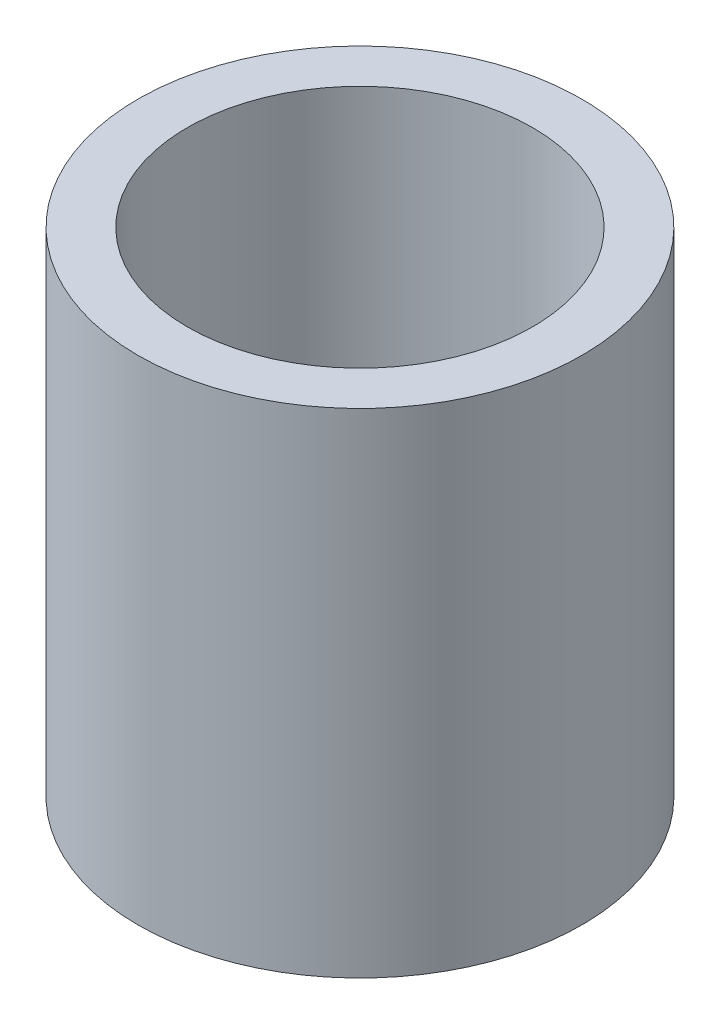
ISO-10303-21;
HEADER;
FILE_DESCRIPTION(('STEP AP214'),'2;1');
FILE_NAME('part.step','',(''),(''),'','','');
FILE_SCHEMA(('AUTOMOTIVE_DESIGN { 1 0 10303 214 1 1 1 1 }'));
ENDSEC;
DATA;
#1=APPLICATION_CONTEXT('core data for automotive mechanical design processes');
#2=APPLICATION_PROTOCOL_DEFINITION('international standard','automotive_design',2000,#1);
#3=PRODUCT_CONTEXT('',#1,'mechanical');
#4=PRODUCT('Part','Part','',(#3));
#5=PRODUCT_RELATED_PRODUCT_CATEGORY('part','',(#4));
#6=PRODUCT_DEFINITION_FORMATION('','',#4);
#7=PRODUCT_DEFINITION_CONTEXT('part definition',#1,'design');
#8=PRODUCT_DEFINITION('design','',#6,#7);
#9=PRODUCT_DEFINITION_SHAPE('','',#8);
#10=(LENGTH_UNIT() NAMED_UNIT(*) SI_UNIT(.MILLI.,.METRE.));
#11=(NAMED_UNIT(*) PLANE_ANGLE_UNIT() SI_UNIT($,.RADIAN.));
#12=(NAMED_UNIT(*) SI_UNIT($,.STERADIAN.) SOLID_ANGLE_UNIT());
#13=UNCERTAINTY_MEASURE_WITH_UNIT(LENGTH_MEASURE(1.E-05),#10,'distance_accuracy_value','');
#14=(GEOMETRIC_REPRESENTATION_CONTEXT(3) GLOBAL_UNCERTAINTY_ASSIGNED_CONTEXT((#13)) GLOBAL_UNIT_ASSIGNED_CONTEXT((#10,
#11,#12)) REPRESENTATION_CONTEXT('',''));
#15=CARTESIAN_POINT('',(0.,0.,0.));
#16=DIRECTION('',(0.,0.,1.));
#17=DIRECTION('',(1.,0.,0.));
#18=AXIS2_PLACEMENT_3D('',#15,#16,#17);
#19=CARTESIAN_POINT('',(0.,50.,0.));
#20=DIRECTION('',(0.,1.,0.));
#21=DIRECTION('',(0.,0.,1.));
#22=AXIS2_PLACEMENT_3D('',#19,#20,#21);
#23=PLANE('',#22);
#24=CARTESIAN_POINT('',(0.,50.,0.));
#25=DIRECTION('',(0.,1.,0.));
#26=DIRECTION('',(0.,0.,1.));
#27=AXIS2_PLACEMENT_3D('',#24,#25,#26);
#28=CIRCLE('',#27,22.5);
#29=CARTESIAN_POINT('',(0.,50.,22.5));
#30=VERTEX_POINT('',#29);
#31=EDGE_CURVE('E10',#30,#30,#28,.T.);
#32=ORIENTED_EDGE('',*,*,#31,.T.);
#33=EDGE_LOOP('',(#32));
#34=FACE_BOUND('',#33,.T.);
#35=CARTESIAN_POINT('',(0.,50.,0.));
#36=DIRECTION('',(0.,1.,0.));
#37=DIRECTION('',(0.,0.,1.));
#38=AXIS2_PLACEMENT_3D('',#35,#36,#37);
#39=CIRCLE('',#38,17.5);
#40=CARTESIAN_POINT('',(0.,50.,17.5));
#41=VERTEX_POINT('',#40);
#42=EDGE_CURVE('E35',#41,#41,#39,.T.);
#43=ORIENTED_EDGE('',*,*,#42,.F.);
#44=EDGE_LOOP('',(#43));
#45=FACE_BOUND('',#44,.T.);
#46=ADVANCED_FACE('F24',(#34,#45),#23,.T.);
#47=CARTESIAN_POINT('',(0.,0.,0.));
#48=DIRECTION('',(0.,1.,0.));
#49=DIRECTION('',(0.,0.,1.));
#50=AXIS2_PLACEMENT_3D('',#47,#48,#49);
#51=PLANE('',#50);
#52=CARTESIAN_POINT('',(0.,0.,0.));
#53=DIRECTION('',(0.,1.,0.));
#54=DIRECTION('',(0.,0.,1.));
#55=AXIS2_PLACEMENT_3D('',#52,#53,#54);
#56=CIRCLE('',#55,22.5);
#57=CARTESIAN_POINT('',(0.,0.,22.5));
#58=VERTEX_POINT('',#57);
#59=EDGE_CURVE('E31',#58,#58,#56,.T.);
#60=ORIENTED_EDGE('',*,*,#59,.F.);
#61=EDGE_LOOP('',(#60));
#62=FACE_BOUND('',#61,.T.);
#63=CARTESIAN_POINT('',(0.,0.,0.));
#64=DIRECTION('',(0.,1.,0.));
#65=DIRECTION('',(0.,0.,1.));
#66=AXIS2_PLACEMENT_3D('',#63,#64,#65);
#67=CIRCLE('',#66,17.5);
#68=CARTESIAN_POINT('',(0.,0.,17.5));
#69=VERTEX_POINT('',#68);
#70=EDGE_CURVE('E39',#69,#69,#67,.T.);
#71=ORIENTED_EDGE('',*,*,#70,.T.);
#72=EDGE_LOOP('',(#71));
#73=FACE_BOUND('',#72,.T.);
#74=ADVANCED_FACE('F45',(#62,#73),#51,.F.);
#75=CARTESIAN_POINT('',(0.,50.,0.));
#76=DIRECTION('',(0.,-1.,0.));
#77=DIRECTION('',(0.,0.,-1.));
#78=AXIS2_PLACEMENT_3D('',#75,#76,#77);
#79=CYLINDRICAL_SURFACE('',#78,22.5);
#80=ORIENTED_EDGE('',*,*,#31,.F.);
#81=EDGE_LOOP('',(#80));
#82=FACE_BOUND('',#81,.T.);
#83=ORIENTED_EDGE('',*,*,#59,.T.);
#84=EDGE_LOOP('',(#83));
#85=FACE_BOUND('',#84,.T.);
#86=ADVANCED_FACE('F26',(#82,#85),#79,.T.);
#87=CARTESIAN_POINT('',(0.,50.,0.));
#88=DIRECTION('',(0.,-1.,0.));
#89=DIRECTION('',(0.,0.,-1.));
#90=AXIS2_PLACEMENT_3D('',#87,#88,#89);
#91=CYLINDRICAL_SURFACE('',#90,17.5);
#92=ORIENTED_EDGE('',*,*,#42,.T.);
#93=EDGE_LOOP('',(#92));
#94=FACE_BOUND('',#93,.T.);
#95=ORIENTED_EDGE('',*,*,#70,.F.);
#96=EDGE_LOOP('',(#95));
#97=FACE_BOUND('',#96,.T.);
#98=ADVANCED_FACE('F47',(#94,#97),#91,.F.);
#99=CLOSED_SHELL('',(#46,#74,#86,#98));
#100=MANIFOLD_SOLID_BREP('B2',#99);
#101=ADVANCED_BREP_SHAPE_REPRESENTATION('',(#18,#100),#14);
#102=SHAPE_DEFINITION_REPRESENTATION(#9,#101);
ENDSEC;
END-ISO-10303-21;
